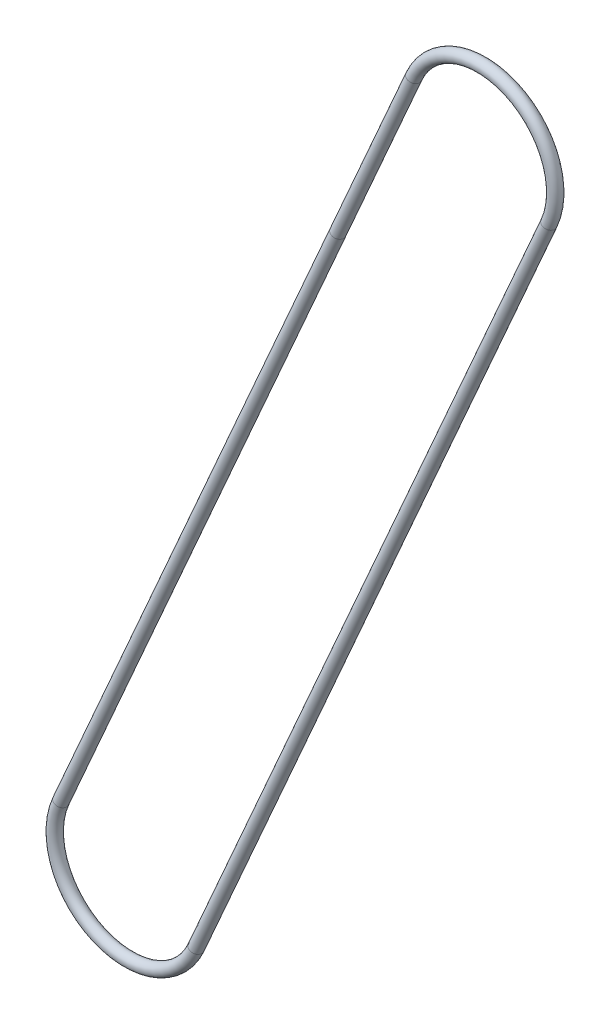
from build123d import *

# Parameters (mm, degrees)
SKETCH2_R = 2.38125


with BuildPart() as part:
    # Sweep1: sweep along a path in Sketch1
    with BuildLine(Plane.XY) as sweep1_path:
        Line((-110.427187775, -322.545256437), (26.163614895, -11.488946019))
        ThreePointArc((26.163614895, -11.488946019), (11.488946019, 26.163614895), (-26.163614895, 11.488946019))
        Line((-26.163614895, 11.488946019), (-162.754417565, -299.567364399))
        ThreePointArc((-162.754417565, -299.567364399), (-148.079748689, -337.219925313), (-110.427187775, -322.545256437))
    # Sketch2 → Sweep1 (sweep)
    with BuildSketch(Plane(origin=(-29.360639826, -66.862571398, 0), x_dir=(0, 0, 1), z_dir=(-0.4020628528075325, -0.9156120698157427, 0))):
        with Locations((0, 28.575)):
            Circle(SKETCH2_R)
    sweep(path=sweep1_path.line)


solid = part.part
